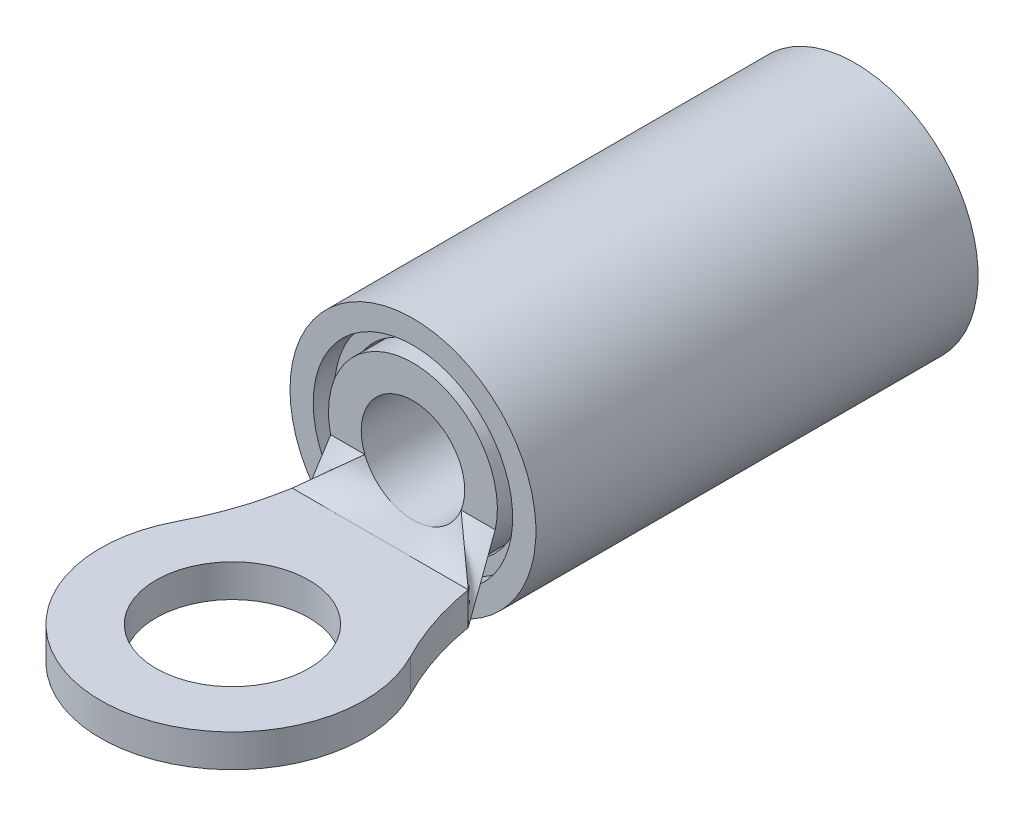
ISO-10303-21;
HEADER;
FILE_DESCRIPTION(('STEP AP214'),'2;1');
FILE_NAME('part.step','',(''),(''),'','','');
FILE_SCHEMA(('AUTOMOTIVE_DESIGN { 1 0 10303 214 1 1 1 1 }'));
ENDSEC;
DATA;
#1=APPLICATION_CONTEXT('core data for automotive mechanical design processes');
#2=APPLICATION_PROTOCOL_DEFINITION('international standard','automotive_design',2000,#1);
#3=PRODUCT_CONTEXT('',#1,'mechanical');
#4=PRODUCT('Part','Part','',(#3));
#5=PRODUCT_RELATED_PRODUCT_CATEGORY('part','',(#4));
#6=PRODUCT_DEFINITION_FORMATION('','',#4);
#7=PRODUCT_DEFINITION_CONTEXT('part definition',#1,'design');
#8=PRODUCT_DEFINITION('design','',#6,#7);
#9=PRODUCT_DEFINITION_SHAPE('','',#8);
#10=(LENGTH_UNIT() NAMED_UNIT(*) SI_UNIT(.MILLI.,.METRE.));
#11=(NAMED_UNIT(*) PLANE_ANGLE_UNIT() SI_UNIT($,.RADIAN.));
#12=(NAMED_UNIT(*) SI_UNIT($,.STERADIAN.) SOLID_ANGLE_UNIT());
#13=UNCERTAINTY_MEASURE_WITH_UNIT(LENGTH_MEASURE(1.E-05),#10,'distance_accuracy_value','');
#14=(GEOMETRIC_REPRESENTATION_CONTEXT(3) GLOBAL_UNCERTAINTY_ASSIGNED_CONTEXT((#13)) GLOBAL_UNIT_ASSIGNED_CONTEXT((#10,
#11,#12)) REPRESENTATION_CONTEXT('',''));
#15=CARTESIAN_POINT('',(0.,0.,0.));
#16=DIRECTION('',(0.,0.,1.));
#17=DIRECTION('',(1.,0.,0.));
#18=AXIS2_PLACEMENT_3D('',#15,#16,#17);
#19=CARTESIAN_POINT('',(-2.223273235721,0.7705356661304,-3.540252));
#20=CARTESIAN_POINT('',(-1.86805110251,1.062850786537,-3.813217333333));
#21=CARTESIAN_POINT('',(-1.5128289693,1.355165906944,-4.086182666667));
#22=CARTESIAN_POINT('',(-1.15760683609,1.647481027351,-4.359148));
#23=CARTESIAN_POINT('',(-2.194595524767,0.7709109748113,-3.540252));
#24=CARTESIAN_POINT('',(-1.846947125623,1.056720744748,-3.813217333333));
#25=CARTESIAN_POINT('',(-1.499298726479,1.342530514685,-4.086182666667));
#26=CARTESIAN_POINT('',(-1.151650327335,1.628340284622,-4.359148));
#27=CARTESIAN_POINT('',(-1.807565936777,0.7759372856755,-3.540252));
#28=CARTESIAN_POINT('',(-1.560091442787,0.9746243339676,-3.813217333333));
#29=CARTESIAN_POINT('',(-1.312616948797,1.17331138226,-4.086182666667));
#30=CARTESIAN_POINT('',(-1.065142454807,1.371998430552,-4.359148));
#31=CARTESIAN_POINT('',(-1.065350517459,0.7843492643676,-3.540252));
#32=CARTESIAN_POINT('',(-0.9557719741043,0.837228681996,-3.813217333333));
#33=CARTESIAN_POINT('',(-0.8461934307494,0.8901080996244,-4.086182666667));
#34=CARTESIAN_POINT('',(-0.7366148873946,0.9429875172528,-4.359148));
#35=CARTESIAN_POINT('',(0.,0.7889253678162,-3.540252));
#36=CARTESIAN_POINT('',(0.,0.762485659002,-3.813217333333));
#37=CARTESIAN_POINT('',(0.,0.7360459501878,-4.086182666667));
#38=CARTESIAN_POINT('',(0.,0.7096062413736,-4.359148));
#39=CARTESIAN_POINT('',(1.065350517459,0.7843492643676,-3.540252));
#40=CARTESIAN_POINT('',(0.9557719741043,0.837228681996,-3.813217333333));
#41=CARTESIAN_POINT('',(0.8461934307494,0.8901080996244,-4.086182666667));
#42=CARTESIAN_POINT('',(0.7366148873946,0.9429875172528,-4.359148));
#43=CARTESIAN_POINT('',(1.807565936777,0.7759372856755,-3.540252));
#44=CARTESIAN_POINT('',(1.560091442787,0.9746243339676,-3.813217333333));
#45=CARTESIAN_POINT('',(1.312616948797,1.17331138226,-4.086182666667));
#46=CARTESIAN_POINT('',(1.065142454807,1.371998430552,-4.359148));
#47=CARTESIAN_POINT('',(2.194595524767,0.7709109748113,-3.540252));
#48=CARTESIAN_POINT('',(1.846947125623,1.056720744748,-3.813217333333));
#49=CARTESIAN_POINT('',(1.499298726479,1.342530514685,-4.086182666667));
#50=CARTESIAN_POINT('',(1.151650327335,1.628340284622,-4.359148));
#51=CARTESIAN_POINT('',(2.223273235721,0.7705356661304,-3.540252));
#52=CARTESIAN_POINT('',(1.86805110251,1.062850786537,-3.813217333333));
#53=CARTESIAN_POINT('',(1.5128289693,1.355165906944,-4.086182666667));
#54=CARTESIAN_POINT('',(1.15760683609,1.647481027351,-4.359148));
#55=B_SPLINE_SURFACE_WITH_KNOTS('',3,3,((#19,#20,#21,#22),(#23,#24,#25,#26),(#27,#28,#29,#30),
(#31,#32,#33,#34),(#35,#36,#37,#38),(#39,#40,#41,#42),(#43,#44,#45,#46),(#47,#48,#49,#50),(#51,
#52,#53,#54)),.UNSPECIFIED.,.F.,.F.,.F.,(4,1,1,1,1,1,4),(4,4),(-0.02,0.,0.25,0.5,0.75,1.,1.02),
(-0.02,1.02),.UNSPECIFIED.);
#56=CARTESIAN_POINT('',(1.1781004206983,1.63061669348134,-4.3434));
#57=CARTESIAN_POINT('',(1.17170696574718,1.6118512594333,-4.3434));
#58=CARTESIAN_POINT('',(1.07941982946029,1.36053571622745,-4.3434));
#59=CARTESIAN_POINT('',(0.742936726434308,0.939936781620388,-4.3434));
#60=CARTESIAN_POINT('',(0.,0.711131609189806,-4.3434));
#61=CARTESIAN_POINT('',(-0.742936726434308,0.939936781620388,-4.3434));
#62=CARTESIAN_POINT('',(-1.07941982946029,1.36053571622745,-4.3434));
#63=CARTESIAN_POINT('',(-1.17170696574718,1.6118512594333,-4.3434));
#64=CARTESIAN_POINT('',(-1.1781004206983,1.63061669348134,-4.3434));
#65=B_SPLINE_CURVE_WITH_KNOTS('',3,(#56,#57,#58,#59,#60,#61,#62,#63,#64),.UNSPECIFIED.,.F.,.F.,
(4,1,1,1,1,1,4),(-0.02,0.,0.25,0.5,0.75,1.,1.02),.UNSPECIFIED.);
#66=CARTESIAN_POINT('',(0.,0.7874,-4.34339999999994));
#67=VERTEX_POINT('',#66);
#68=CARTESIAN_POINT('',(-1.15758253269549,1.57480000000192,-4.34339999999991));
#69=VERTEX_POINT('',#68);
#70=EDGE_CURVE('E199',#67,#69,#65,.T.);
#71=DIRECTION('',(-0.653141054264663,-0.53544689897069,0.535446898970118));
#72=VECTOR('',#71,1.);
#73=CARTESIAN_POINT('',(-1.637819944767,1.18110000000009,-3.9497));
#74=LINE('',#73,#72);
#75=CARTESIAN_POINT('',(-2.1180573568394,0.787399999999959,-3.55600000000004));
#76=VERTEX_POINT('',#75);
#77=EDGE_CURVE('E78',#69,#76,#74,.T.);
#78=DIRECTION('',(1.,0.,0.));
#79=VECTOR('',#78,1.);
#80=CARTESIAN_POINT('',(0.,0.7874,-3.556));
#81=LINE('',#80,#79);
#82=CARTESIAN_POINT('',(2.1180573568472,0.787399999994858,-3.55599999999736));
#83=VERTEX_POINT('',#82);
#84=EDGE_CURVE('E91',#83,#76,#81,.F.);
#85=DIRECTION('',(-0.653141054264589,0.535446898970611,-0.535446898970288));
#86=VECTOR('',#85,1.);
#87=CARTESIAN_POINT('',(1.63781994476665,1.18109999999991,-3.9497));
#88=LINE('',#87,#86);
#89=CARTESIAN_POINT('',(1.15758253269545,1.5748000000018,-4.3433999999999));
#90=VERTEX_POINT('',#89);
#91=EDGE_CURVE('E202',#83,#90,#88,.T.);
#92=CARTESIAN_POINT('',(1.17810042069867,1.63061669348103,-4.34339999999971));
#93=CARTESIAN_POINT('',(1.17170696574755,1.611851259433,-4.34339999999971));
#94=CARTESIAN_POINT('',(1.07941982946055,1.36053571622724,-4.34339999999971));
#95=CARTESIAN_POINT('',(0.742936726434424,0.939936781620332,-4.34339999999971));
#96=CARTESIAN_POINT('',(0.,0.711131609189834,-4.34339999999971));
#97=CARTESIAN_POINT('',(-0.742936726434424,0.939936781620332,-4.34339999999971));
#98=CARTESIAN_POINT('',(-1.07941982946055,1.36053571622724,-4.34339999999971));
#99=CARTESIAN_POINT('',(-1.17170696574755,1.611851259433,-4.34339999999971));
#100=CARTESIAN_POINT('',(-1.17810042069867,1.63061669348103,-4.34339999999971));
#101=B_SPLINE_CURVE_WITH_KNOTS('',3,(#92,#93,#94,#95,#96,#97,#98,#99,#100),.UNSPECIFIED.,.F.,
.F.,(4,1,1,1,1,1,4),(-0.02,0.,0.25,0.5,0.75,1.,1.02),.UNSPECIFIED.);
#102=EDGE_CURVE('E205',#90,#67,#101,.T.);
#103=ORIENTED_EDGE('',*,*,#70,.T.);
#104=ORIENTED_EDGE('',*,*,#77,.T.);
#105=ORIENTED_EDGE('',*,*,#84,.F.);
#106=ORIENTED_EDGE('',*,*,#91,.T.);
#107=ORIENTED_EDGE('',*,*,#102,.T.);
#108=EDGE_LOOP('',(#103,#104,#105,#106,#107));
#109=FACE_BOUND('',#108,.T.);
#110=ADVANCED_FACE('F15',(#109),#55,.T.);
#111=CARTESIAN_POINT('',(0.,0.7874,0.));
#112=DIRECTION('',(0.,1.,0.));
#113=DIRECTION('',(0.,0.,1.));
#114=AXIS2_PLACEMENT_3D('',#111,#112,#113);
#115=PLANE('',#114);
#116=CARTESIAN_POINT('',(0.,0.7874,0.));
#117=DIRECTION('',(0.,1.,0.));
#118=DIRECTION('',(0.,0.,1.));
#119=AXIS2_PLACEMENT_3D('',#116,#117,#118);
#120=CIRCLE('',#119,1.8415);
#121=CARTESIAN_POINT('',(0.,0.7874,1.8415));
#122=VERTEX_POINT('',#121);
#123=EDGE_CURVE('E286',#122,#122,#120,.F.);
#124=ORIENTED_EDGE('',*,*,#123,.T.);
#125=EDGE_LOOP('',(#124));
#126=FACE_BOUND('',#125,.T.);
#127=CARTESIAN_POINT('',(0.,0.7874,0.));
#128=DIRECTION('',(0.,1.,0.));
#129=DIRECTION('',(0.,0.,1.));
#130=AXIS2_PLACEMENT_3D('',#127,#128,#129);
#131=CIRCLE('',#130,3.175);
#132=CARTESIAN_POINT('',(2.81657050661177,0.7874,-1.46545405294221));
#133=VERTEX_POINT('',#132);
#134=CARTESIAN_POINT('',(-2.81657050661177,0.7874,-1.46545405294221));
#135=VERTEX_POINT('',#134);
#136=EDGE_CURVE('E89',#133,#135,#131,.F.);
#137=ORIENTED_EDGE('',*,*,#136,.F.);
#138=CARTESIAN_POINT('',(9.058090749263,0.7874,-4.712900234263));
#139=DIRECTION('',(0.,1.,0.));
#140=DIRECTION('',(0.,0.,1.));
#141=AXIS2_PLACEMENT_3D('',#138,#139,#140);
#142=CIRCLE('',#141,7.0358);
#143=EDGE_CURVE('E109',#133,#83,#142,.F.);
#144=ORIENTED_EDGE('',*,*,#143,.T.);
#145=ORIENTED_EDGE('',*,*,#84,.T.);
#146=CARTESIAN_POINT('',(-9.058090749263,0.7874,-4.712900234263));
#147=DIRECTION('',(0.,1.,0.));
#148=DIRECTION('',(0.,0.,1.));
#149=AXIS2_PLACEMENT_3D('',#146,#147,#148);
#150=CIRCLE('',#149,7.0358);
#151=EDGE_CURVE('E84',#76,#135,#150,.F.);
#152=ORIENTED_EDGE('',*,*,#151,.T.);
#153=EDGE_LOOP('',(#137,#144,#145,#152));
#154=FACE_BOUND('',#153,.T.);
#155=ADVANCED_FACE('F86',(#126,#154),#115,.T.);
#156=CARTESIAN_POINT('',(0.,2.032,-8.4836));
#157=DIRECTION('',(0.,0.,-1.));
#158=DIRECTION('',(-1.,0.,0.));
#159=AXIS2_PLACEMENT_3D('',#156,#157,#158);
#160=PLANE('',#159);
#161=CARTESIAN_POINT('',(0.,2.032,-8.4836));
#162=DIRECTION('',(0.,0.,-1.));
#163=DIRECTION('',(-1.,0.,0.));
#164=AXIS2_PLACEMENT_3D('',#161,#162,#163);
#165=CIRCLE('',#164,1.2446);
#166=CARTESIAN_POINT('',(-1.2446,2.032,-8.4836));
#167=VERTEX_POINT('',#166);
#168=EDGE_CURVE('E192',#167,#167,#165,.F.);
#169=ORIENTED_EDGE('',*,*,#168,.T.);
#170=EDGE_LOOP('',(#169));
#171=FACE_BOUND('',#170,.T.);
#172=ADVANCED_FACE('F311',(#171),#160,.F.);
#173=CARTESIAN_POINT('',(-9.058090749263,0.,-4.712900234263));
#174=DIRECTION('',(0.,1.,0.));
#175=DIRECTION('',(0.,0.,1.));
#176=AXIS2_PLACEMENT_3D('',#173,#174,#175);
#177=CYLINDRICAL_SURFACE('',#176,7.0358);
#178=DIRECTION('',(0.,1.,0.));
#179=VECTOR('',#178,1.);
#180=CARTESIAN_POINT('',(-2.8165705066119,0.,-1.46545405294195));
#181=LINE('',#180,#179);
#182=CARTESIAN_POINT('',(-2.81657050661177,0.,-1.46545405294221));
#183=VERTEX_POINT('',#182);
#184=EDGE_CURVE('E96',#135,#183,#181,.F.);
#185=ORIENTED_EDGE('',*,*,#184,.F.);
#186=ORIENTED_EDGE('',*,*,#151,.F.);
#187=DIRECTION('',(0.,1.,0.));
#188=VECTOR('',#187,1.);
#189=CARTESIAN_POINT('',(-2.11805735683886,0.,-3.55599999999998));
#190=LINE('',#189,#188);
#191=CARTESIAN_POINT('',(-2.11805735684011,-4.8139319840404E-13,-3.55600000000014));
#192=VERTEX_POINT('',#191);
#193=EDGE_CURVE('E93',#192,#76,#190,.T.);
#194=ORIENTED_EDGE('',*,*,#193,.F.);
#195=CARTESIAN_POINT('',(-9.058090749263,0.,-4.712900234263));
#196=DIRECTION('',(0.,1.,0.));
#197=DIRECTION('',(0.,0.,1.));
#198=AXIS2_PLACEMENT_3D('',#195,#196,#197);
#199=CIRCLE('',#198,7.0358);
#200=EDGE_CURVE('E99',#192,#183,#199,.F.);
#201=ORIENTED_EDGE('',*,*,#200,.T.);
#202=EDGE_LOOP('',(#185,#186,#194,#201));
#203=FACE_BOUND('',#202,.T.);
#204=ADVANCED_FACE('F97',(#203),#177,.F.);
#205=CARTESIAN_POINT('',(0.,0.,0.));
#206=DIRECTION('',(0.,1.,0.));
#207=DIRECTION('',(0.,0.,1.));
#208=AXIS2_PLACEMENT_3D('',#205,#206,#207);
#209=CYLINDRICAL_SURFACE('',#208,3.175);
#210=ORIENTED_EDGE('',*,*,#184,.T.);
#211=CARTESIAN_POINT('',(0.,0.,0.));
#212=DIRECTION('',(0.,1.,0.));
#213=DIRECTION('',(0.,0.,1.));
#214=AXIS2_PLACEMENT_3D('',#211,#212,#213);
#215=CIRCLE('',#214,3.175);
#216=CARTESIAN_POINT('',(2.81657050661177,0.,-1.46545405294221));
#217=VERTEX_POINT('',#216);
#218=EDGE_CURVE('E282',#183,#217,#215,.T.);
#219=ORIENTED_EDGE('',*,*,#218,.T.);
#220=DIRECTION('',(0.,1.,0.));
#221=VECTOR('',#220,1.);
#222=CARTESIAN_POINT('',(2.81657050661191,0.,-1.46545405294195));
#223=LINE('',#222,#221);
#224=EDGE_CURVE('E102',#217,#133,#223,.T.);
#225=ORIENTED_EDGE('',*,*,#224,.T.);
#226=ORIENTED_EDGE('',*,*,#136,.T.);
#227=EDGE_LOOP('',(#210,#219,#225,#226));
#228=FACE_BOUND('',#227,.T.);
#229=ADVANCED_FACE('F104',(#228),#209,.T.);
#230=CARTESIAN_POINT('',(9.058090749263,0.,-4.712900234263));
#231=DIRECTION('',(0.,1.,0.));
#232=DIRECTION('',(0.,0.,1.));
#233=AXIS2_PLACEMENT_3D('',#230,#231,#232);
#234=CYLINDRICAL_SURFACE('',#233,7.0358);
#235=ORIENTED_EDGE('',*,*,#224,.F.);
#236=CARTESIAN_POINT('',(9.058090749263,0.,-4.712900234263));
#237=DIRECTION('',(0.,1.,0.));
#238=DIRECTION('',(0.,0.,1.));
#239=AXIS2_PLACEMENT_3D('',#236,#237,#238);
#240=CIRCLE('',#239,7.0358);
#241=CARTESIAN_POINT('',(2.11805735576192,1.00318079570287E-11,-3.55599999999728));
#242=VERTEX_POINT('',#241);
#243=EDGE_CURVE('E279',#217,#242,#240,.F.);
#244=ORIENTED_EDGE('',*,*,#243,.T.);
#245=DIRECTION('',(-5.08995019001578E-11,-1.,0.));
#246=VECTOR('',#245,1.);
#247=CARTESIAN_POINT('',(2.11805735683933,0.393699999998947,-3.55599999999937));
#248=LINE('',#247,#246);
#249=EDGE_CURVE('E189',#83,#242,#248,.T.);
#250=ORIENTED_EDGE('',*,*,#249,.F.);
#251=ORIENTED_EDGE('',*,*,#143,.F.);
#252=EDGE_LOOP('',(#235,#244,#250,#251));
#253=FACE_BOUND('',#252,.T.);
#254=ADVANCED_FACE('F292',(#253),#234,.F.);
#255=CARTESIAN_POINT('',(0.,0.,0.));
#256=DIRECTION('',(0.,1.,0.));
#257=DIRECTION('',(0.,0.,1.));
#258=AXIS2_PLACEMENT_3D('',#255,#256,#257);
#259=CYLINDRICAL_SURFACE('',#258,1.8415);
#260=ORIENTED_EDGE('',*,*,#123,.F.);
#261=EDGE_LOOP('',(#260));
#262=FACE_BOUND('',#261,.T.);
#263=CARTESIAN_POINT('',(0.,0.,0.));
#264=DIRECTION('',(0.,1.,0.));
#265=DIRECTION('',(0.,0.,1.));
#266=AXIS2_PLACEMENT_3D('',#263,#264,#265);
#267=CIRCLE('',#266,1.8415);
#268=CARTESIAN_POINT('',(0.,0.,1.8415));
#269=VERTEX_POINT('',#268);
#270=EDGE_CURVE('E170',#269,#269,#267,.F.);
#271=ORIENTED_EDGE('',*,*,#270,.T.);
#272=EDGE_LOOP('',(#271));
#273=FACE_BOUND('',#272,.T.);
#274=ADVANCED_FACE('F308',(#262,#273),#259,.F.);
#275=CARTESIAN_POINT('',(0.,2.032,-4.13639));
#276=DIRECTION('',(0.,0.,-1.));
#277=DIRECTION('',(-1.,0.,0.));
#278=AXIS2_PLACEMENT_3D('',#275,#276,#277);
#279=CYLINDRICAL_SURFACE('',#278,1.2446);
#280=ORIENTED_EDGE('',*,*,#70,.F.);
#281=ORIENTED_EDGE('',*,*,#102,.F.);
#282=CARTESIAN_POINT('',(0.,2.032,-4.3434));
#283=DIRECTION('',(0.,0.,-1.));
#284=DIRECTION('',(-1.,0.,0.));
#285=AXIS2_PLACEMENT_3D('',#282,#283,#284);
#286=CIRCLE('',#285,1.2446);
#287=EDGE_CURVE('E159',#90,#69,#286,.F.);
#288=ORIENTED_EDGE('',*,*,#287,.T.);
#289=EDGE_LOOP('',(#280,#281,#288));
#290=FACE_BOUND('',#289,.T.);
#291=ORIENTED_EDGE('',*,*,#168,.F.);
#292=EDGE_LOOP('',(#291));
#293=FACE_BOUND('',#292,.T.);
#294=ADVANCED_FACE('F305',(#290,#293),#279,.F.);
#295=CARTESIAN_POINT('',(2.137771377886,0.7962902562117,-3.540252));
#296=CARTESIAN_POINT('',(1.796061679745,1.06088180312,-3.813217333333));
#297=CARTESIAN_POINT('',(1.454351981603,1.325473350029,-4.086182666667));
#298=CARTESIAN_POINT('',(1.112642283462,1.590064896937,-4.359148));
#299=CARTESIAN_POINT('',(2.137603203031,0.7880775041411,-3.540252));
#300=CARTESIAN_POINT('',(1.798808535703,1.055460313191,-3.813217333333));
#301=CARTESIAN_POINT('',(1.460013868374,1.322843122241,-4.086182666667));
#302=CARTESIAN_POINT('',(1.121219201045,1.590225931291,-4.359148));
#303=CARTESIAN_POINT('',(2.131952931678,0.5121487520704,-3.540252));
#304=CARTESIAN_POINT('',(1.891096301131,0.8733112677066,-3.813217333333));
#305=CARTESIAN_POINT('',(1.650239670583,1.234473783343,-4.086182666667));
#306=CARTESIAN_POINT('',(1.409383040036,1.595636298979,-4.359148));
#307=CARTESIAN_POINT('',(2.126134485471,0.2280072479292,-3.540252));
#308=CARTESIAN_POINT('',(1.986130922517,0.6857407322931,-3.813217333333));
#309=CARTESIAN_POINT('',(1.846127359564,1.143474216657,-4.086182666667));
#310=CARTESIAN_POINT('',(1.70612379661,1.601207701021,-4.359148));
#311=CARTESIAN_POINT('',(2.120484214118,-0.04792150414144,-3.540252));
#312=CARTESIAN_POINT('',(2.078418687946,0.5035916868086,-3.813217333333));
#313=CARTESIAN_POINT('',(2.036353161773,1.055104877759,-4.086182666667));
#314=CARTESIAN_POINT('',(1.9942876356,1.606618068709,-4.359148));
#315=CARTESIAN_POINT('',(2.120316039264,-0.05613425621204,-3.540252));
#316=CARTESIAN_POINT('',(2.081165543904,0.4981701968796,-3.813217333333));
#317=CARTESIAN_POINT('',(2.042015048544,1.052474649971,-4.086182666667));
#318=CARTESIAN_POINT('',(2.002864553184,1.606779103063,-4.359148));
#319=B_SPLINE_SURFACE_WITH_KNOTS('',3,3,((#295,#296,#297,#298),(#299,#300,#301,#302),(#303,#304,
#305,#306),(#307,#308,#309,#310),(#311,#312,#313,#314),(#315,#316,#317,#318)),.UNSPECIFIED.,.F.,
.F.,.F.,(4,1,1,4),(4,4),(-0.03067710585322,0.,1.,1.030677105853),(-0.02000000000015,1.02),.UNSPECIFIED.);
#320=DIRECTION('',(0.0782294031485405,-0.891686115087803,0.445843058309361));
#321=VECTOR('',#320,1.);
#322=CARTESIAN_POINT('',(2.04897718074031,0.787399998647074,-3.9497));
#323=LINE('',#322,#321);
#324=CARTESIAN_POINT('',(1.97989700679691,1.57479999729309,-4.34339999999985));
#325=VERTEX_POINT('',#324);
#326=EDGE_CURVE('E151',#325,#242,#323,.T.);
#327=DIRECTION('',(-1.,0.,0.));
#328=VECTOR('',#327,1.);
#329=CARTESIAN_POINT('',(0.,1.574799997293,-4.3434));
#330=LINE('',#329,#328);
#331=EDGE_CURVE('E162',#325,#90,#330,.T.);
#332=ORIENTED_EDGE('',*,*,#326,.F.);
#333=ORIENTED_EDGE('',*,*,#331,.T.);
#334=ORIENTED_EDGE('',*,*,#91,.F.);
#335=ORIENTED_EDGE('',*,*,#249,.T.);
#336=EDGE_LOOP('',(#332,#333,#334,#335));
#337=FACE_BOUND('',#336,.T.);
#338=ADVANCED_FACE('F227',(#337),#319,.T.);
#339=CARTESIAN_POINT('',(0.,0.,0.));
#340=DIRECTION('',(0.,1.,0.));
#341=DIRECTION('',(0.,0.,1.));
#342=AXIS2_PLACEMENT_3D('',#339,#340,#341);
#343=PLANE('',#342);
#344=ORIENTED_EDGE('',*,*,#270,.F.);
#345=EDGE_LOOP('',(#344));
#346=FACE_BOUND('',#345,.T.);
#347=DIRECTION('',(-1.,1.70301800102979E-13,0.));
#348=VECTOR('',#347,1.);
#349=CARTESIAN_POINT('',(0.,0.,-3.556));
#350=LINE('',#349,#348);
#351=EDGE_CURVE('E158',#242,#192,#350,.T.);
#352=ORIENTED_EDGE('',*,*,#351,.F.);
#353=ORIENTED_EDGE('',*,*,#243,.F.);
#354=ORIENTED_EDGE('',*,*,#218,.F.);
#355=ORIENTED_EDGE('',*,*,#200,.F.);
#356=EDGE_LOOP('',(#352,#353,#354,#355));
#357=FACE_BOUND('',#356,.T.);
#358=ADVANCED_FACE('F299',(#346,#357),#343,.F.);
#359=CARTESIAN_POINT('',(-2.120316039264,-0.05613425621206,-3.540252));
#360=CARTESIAN_POINT('',(-2.081165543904,0.4981701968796,-3.813217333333));
#361=CARTESIAN_POINT('',(-2.042015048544,1.052474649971,-4.086182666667));
#362=CARTESIAN_POINT('',(-2.002864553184,1.606779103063,-4.359148));
#363=CARTESIAN_POINT('',(-2.120484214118,-0.04792150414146,-3.540252));
#364=CARTESIAN_POINT('',(-2.078418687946,0.5035916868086,-3.813217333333));
#365=CARTESIAN_POINT('',(-2.036353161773,1.055104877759,-4.086182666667));
#366=CARTESIAN_POINT('',(-1.9942876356,1.606618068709,-4.359148));
#367=CARTESIAN_POINT('',(-2.126134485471,0.2280072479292,-3.540252));
#368=CARTESIAN_POINT('',(-1.986130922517,0.6857407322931,-3.813217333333));
#369=CARTESIAN_POINT('',(-1.846127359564,1.143474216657,-4.086182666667));
#370=CARTESIAN_POINT('',(-1.70612379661,1.601207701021,-4.359148));
#371=CARTESIAN_POINT('',(-2.131952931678,0.5121487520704,-3.540252));
#372=CARTESIAN_POINT('',(-1.891096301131,0.8733112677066,-3.813217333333));
#373=CARTESIAN_POINT('',(-1.650239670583,1.234473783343,-4.086182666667));
#374=CARTESIAN_POINT('',(-1.409383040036,1.595636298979,-4.359148));
#375=CARTESIAN_POINT('',(-2.137603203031,0.7880775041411,-3.540252));
#376=CARTESIAN_POINT('',(-1.798808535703,1.055460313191,-3.813217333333));
#377=CARTESIAN_POINT('',(-1.460013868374,1.322843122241,-4.086182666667));
#378=CARTESIAN_POINT('',(-1.121219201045,1.590225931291,-4.359148));
#379=CARTESIAN_POINT('',(-2.137771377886,0.7962902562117,-3.540252));
#380=CARTESIAN_POINT('',(-1.796061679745,1.06088180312,-3.813217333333));
#381=CARTESIAN_POINT('',(-1.454351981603,1.325473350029,-4.086182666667));
#382=CARTESIAN_POINT('',(-1.112642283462,1.590064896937,-4.359148));
#383=B_SPLINE_SURFACE_WITH_KNOTS('',3,3,((#359,#360,#361,#362),(#363,#364,#365,#366),(#367,#368,
#369,#370),(#371,#372,#373,#374),(#375,#376,#377,#378),(#379,#380,#381,#382)),.UNSPECIFIED.,.F.,
.F.,.F.,(4,1,1,4),(4,4),(-0.03067710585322,0.,1.,1.030677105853),(-0.02000000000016,1.02),.UNSPECIFIED.);
#384=DIRECTION('',(-1.,0.,0.));
#385=VECTOR('',#384,1.);
#386=CARTESIAN_POINT('',(0.,1.5748,-4.3434));
#387=LINE('',#386,#385);
#388=CARTESIAN_POINT('',(-1.97989700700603,1.57479999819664,-4.34339999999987));
#389=VERTEX_POINT('',#388);
#390=EDGE_CURVE('E165',#69,#389,#387,.T.);
#391=DIRECTION('',(0.0782294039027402,0.89168611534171,-0.445843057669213));
#392=VECTOR('',#391,1.);
#393=CARTESIAN_POINT('',(-2.04897718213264,0.787400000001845,-3.9497));
#394=LINE('',#393,#392);
#395=EDGE_CURVE('E176',#192,#389,#394,.T.);
#396=ORIENTED_EDGE('',*,*,#77,.F.);
#397=ORIENTED_EDGE('',*,*,#390,.T.);
#398=ORIENTED_EDGE('',*,*,#395,.F.);
#399=ORIENTED_EDGE('',*,*,#193,.T.);
#400=EDGE_LOOP('',(#396,#397,#398,#399));
#401=FACE_BOUND('',#400,.T.);
#402=ADVANCED_FACE('F301',(#401),#383,.T.);
#403=CARTESIAN_POINT('',(0.,2.032,-4.3434));
#404=DIRECTION('',(0.,0.,-1.));
#405=DIRECTION('',(-1.,0.,0.));
#406=AXIS2_PLACEMENT_3D('',#403,#404,#405);
#407=PLANE('',#406);
#408=ORIENTED_EDGE('',*,*,#287,.F.);
#409=ORIENTED_EDGE('',*,*,#331,.F.);
#410=CARTESIAN_POINT('',(0.,2.032,-4.3434));
#411=DIRECTION('',(0.,0.,-1.));
#412=DIRECTION('',(-1.,0.,0.));
#413=AXIS2_PLACEMENT_3D('',#410,#411,#412);
#414=CIRCLE('',#413,2.032);
#415=EDGE_CURVE('E269',#389,#325,#414,.T.);
#416=ORIENTED_EDGE('',*,*,#415,.F.);
#417=ORIENTED_EDGE('',*,*,#390,.F.);
#418=EDGE_LOOP('',(#408,#409,#416,#417));
#419=FACE_BOUND('',#418,.T.);
#420=ADVANCED_FACE('F132',(#419),#407,.F.);
#421=CARTESIAN_POINT('',(2.206803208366,-0.03363673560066,-3.540252));
#422=CARTESIAN_POINT('',(2.137061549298,0.5494000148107,-3.813217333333));
#423=CARTESIAN_POINT('',(2.067319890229,1.132436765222,-4.086182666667));
#424=CARTESIAN_POINT('',(1.99757823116,1.715473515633,-4.359148));
#425=CARTESIAN_POINT('',(2.178123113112,-0.03291943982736,-3.540252));
#426=CARTESIAN_POINT('',(2.115996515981,0.5376841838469,-3.813217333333));
#427=CARTESIAN_POINT('',(2.053869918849,1.108287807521,-4.086182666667));
#428=CARTESIAN_POINT('',(1.991743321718,1.678891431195,-4.359148));
#429=CARTESIAN_POINT('',(1.791197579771,-0.0232789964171,-3.540252));
#430=CARTESIAN_POINT('',(1.827441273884,0.380223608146,-3.813217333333));
#431=CARTESIAN_POINT('',(1.863684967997,0.7837262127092,-4.086182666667));
#432=CARTESIAN_POINT('',(1.89992866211,1.187228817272,-4.359148));
#433=CARTESIAN_POINT('',(1.230406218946,-0.01044825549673,-3.540252));
#434=CARTESIAN_POINT('',(1.31927836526,0.1706548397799,-3.813217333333));
#435=CARTESIAN_POINT('',(1.408150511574,0.3517579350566,-4.086182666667));
#436=CARTESIAN_POINT('',(1.497022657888,0.5328610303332,-4.359148));
#437=CARTESIAN_POINT('',(0.5264551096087,-0.001545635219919,-3.540252));
#438=CARTESIAN_POINT('',(0.5794817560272,0.02524537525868,-3.813217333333));
#439=CARTESIAN_POINT('',(0.6325084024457,0.05203638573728,-4.086182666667));
#440=CARTESIAN_POINT('',(0.6855350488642,0.07882739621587,-4.359148));
#441=CARTESIAN_POINT('',(0.,0.0007728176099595,-3.540252));
#442=CARTESIAN_POINT('',(0.,-0.01262268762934,-3.813217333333));
#443=CARTESIAN_POINT('',(0.,-0.02601819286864,-4.086182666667));
#444=CARTESIAN_POINT('',(0.,-0.03941369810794,-4.359148));
#445=CARTESIAN_POINT('',(-0.5264551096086,-0.001545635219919,-3.540252));
#446=CARTESIAN_POINT('',(-0.5794817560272,0.02524537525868,-3.813217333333));
#447=CARTESIAN_POINT('',(-0.6325084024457,0.05203638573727,-4.086182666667));
#448=CARTESIAN_POINT('',(-0.6855350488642,0.07882739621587,-4.359148));
#449=CARTESIAN_POINT('',(-1.230406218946,-0.01044825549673,-3.540252));
#450=CARTESIAN_POINT('',(-1.31927836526,0.1706548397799,-3.813217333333));
#451=CARTESIAN_POINT('',(-1.408150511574,0.3517579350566,-4.086182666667));
#452=CARTESIAN_POINT('',(-1.497022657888,0.5328610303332,-4.359148));
#453=CARTESIAN_POINT('',(-1.791197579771,-0.0232789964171,-3.540252));
#454=CARTESIAN_POINT('',(-1.827441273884,0.380223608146,-3.813217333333));
#455=CARTESIAN_POINT('',(-1.863684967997,0.7837262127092,-4.086182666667));
#456=CARTESIAN_POINT('',(-1.89992866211,1.187228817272,-4.359148));
#457=CARTESIAN_POINT('',(-2.178123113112,-0.03291943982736,-3.540252));
#458=CARTESIAN_POINT('',(-2.115996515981,0.5376841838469,-3.813217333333));
#459=CARTESIAN_POINT('',(-2.053869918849,1.108287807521,-4.086182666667));
#460=CARTESIAN_POINT('',(-1.991743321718,1.678891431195,-4.359148));
#461=CARTESIAN_POINT('',(-2.206803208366,-0.03363673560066,-3.540252));
#462=CARTESIAN_POINT('',(-2.137061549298,0.5494000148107,-3.813217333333));
#463=CARTESIAN_POINT('',(-2.067319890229,1.132436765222,-4.086182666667));
#464=CARTESIAN_POINT('',(-1.99757823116,1.715473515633,-4.359148));
#465=B_SPLINE_SURFACE_WITH_KNOTS('',3,3,((#421,#422,#423,#424),(#425,#426,#427,#428),(#429,#430,
#431,#432),(#433,#434,#435,#436),(#437,#438,#439,#440),(#441,#442,#443,#444),(#445,#446,#447,
#448),(#449,#450,#451,#452),(#453,#454,#455,#456),(#457,#458,#459,#460),(#461,#462,#463,#464)),
.UNSPECIFIED.,.F.,.F.,.F.,(4,1,1,1,1,1,1,1,4),(4,4),(-0.02,0.,0.25,0.375,0.5,0.625,0.75,1.,
1.02),(-0.02,1.02),.UNSPECIFIED.);
#466=CARTESIAN_POINT('',(-2.00160178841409,1.68183678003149,-4.34339999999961));
#467=CARTESIAN_POINT('',(-1.99532754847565,1.6459719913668,-4.34339999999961));
#468=CARTESIAN_POINT('',(-1.89783767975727,1.16394982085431,-4.34339999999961));
#469=CARTESIAN_POINT('',(-1.49189541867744,0.522412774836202,-4.34339999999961));
#470=CARTESIAN_POINT('',(-0.682475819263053,0.0772817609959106,-4.34339999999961));
#471=CARTESIAN_POINT('',(0.,-0.0386408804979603,-4.34339999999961));
#472=CARTESIAN_POINT('',(0.682475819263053,0.0772817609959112,-4.34339999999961));
#473=CARTESIAN_POINT('',(1.49189541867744,0.522412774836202,-4.34339999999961));
#474=CARTESIAN_POINT('',(1.89783767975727,1.16394982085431,-4.34339999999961));
#475=CARTESIAN_POINT('',(1.99532754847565,1.6459719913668,-4.34339999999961));
#476=CARTESIAN_POINT('',(2.00160178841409,1.68183678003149,-4.34339999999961));
#477=B_SPLINE_CURVE_WITH_KNOTS('',3,(#466,#467,#468,#469,#470,#471,#472,#473,#474,#475,#476),
.UNSPECIFIED.,.F.,.F.,(4,1,1,1,1,1,1,1,4),(-0.02,0.,0.25,0.375,0.5,0.625,0.75,1.,1.02),.UNSPECIFIED.);
#478=CARTESIAN_POINT('',(0.,0.,-4.34339999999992));
#479=VERTEX_POINT('',#478);
#480=EDGE_CURVE('E39',#479,#389,#477,.F.);
#481=CARTESIAN_POINT('',(-2.00160178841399,1.68183678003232,-4.3434));
#482=CARTESIAN_POINT('',(-1.99532754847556,1.64597199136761,-4.3434));
#483=CARTESIAN_POINT('',(-1.89783767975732,1.16394982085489,-4.3434));
#484=CARTESIAN_POINT('',(-1.49189541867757,0.52241277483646,-4.3434));
#485=CARTESIAN_POINT('',(-0.682475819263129,0.0772817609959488,-4.3434));
#486=CARTESIAN_POINT('',(0.,-0.0386408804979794,-4.3434));
#487=CARTESIAN_POINT('',(0.682475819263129,0.0772817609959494,-4.3434));
#488=CARTESIAN_POINT('',(1.49189541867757,0.52241277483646,-4.3434));
#489=CARTESIAN_POINT('',(1.89783767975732,1.16394982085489,-4.3434));
#490=CARTESIAN_POINT('',(1.99532754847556,1.64597199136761,-4.3434));
#491=CARTESIAN_POINT('',(2.00160178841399,1.68183678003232,-4.3434));
#492=B_SPLINE_CURVE_WITH_KNOTS('',3,(#481,#482,#483,#484,#485,#486,#487,#488,#489,#490,#491),
.UNSPECIFIED.,.F.,.F.,(4,1,1,1,1,1,1,1,4),(-0.02,0.,0.25,0.375,0.5,0.625,0.75,1.,1.02),.UNSPECIFIED.);
#493=EDGE_CURVE('E147',#325,#479,#492,.F.);
#494=ORIENTED_EDGE('',*,*,#395,.T.);
#495=ORIENTED_EDGE('',*,*,#480,.F.);
#496=ORIENTED_EDGE('',*,*,#493,.F.);
#497=ORIENTED_EDGE('',*,*,#326,.T.);
#498=ORIENTED_EDGE('',*,*,#351,.T.);
#499=EDGE_LOOP('',(#494,#495,#496,#497,#498));
#500=FACE_BOUND('',#499,.T.);
#501=ADVANCED_FACE('F17',(#500),#465,.T.);
#502=CARTESIAN_POINT('',(0.,2.032,-4.13639));
#503=DIRECTION('',(0.,0.,-1.));
#504=DIRECTION('',(-1.,0.,0.));
#505=AXIS2_PLACEMENT_3D('',#502,#503,#504);
#506=CYLINDRICAL_SURFACE('',#505,2.032);
#507=CARTESIAN_POINT('',(0.,2.032,-8.4836));
#508=DIRECTION('',(0.,0.,-1.));
#509=DIRECTION('',(-1.,0.,0.));
#510=AXIS2_PLACEMENT_3D('',#507,#508,#509);
#511=CIRCLE('',#510,2.032);
#512=CARTESIAN_POINT('',(-2.032,2.032,-8.4836));
#513=VERTEX_POINT('',#512);
#514=EDGE_CURVE('E266',#513,#513,#511,.F.);
#515=ORIENTED_EDGE('',*,*,#514,.T.);
#516=EDGE_LOOP('',(#515));
#517=FACE_BOUND('',#516,.T.);
#518=ORIENTED_EDGE('',*,*,#493,.T.);
#519=ORIENTED_EDGE('',*,*,#480,.T.);
#520=ORIENTED_EDGE('',*,*,#415,.T.);
#521=EDGE_LOOP('',(#518,#519,#520));
#522=FACE_BOUND('',#521,.T.);
#523=ADVANCED_FACE('F119',(#517,#522),#506,.T.);
#524=CARTESIAN_POINT('',(0.,2.032,-8.4836));
#525=DIRECTION('',(0.,0.,-1.));
#526=DIRECTION('',(-1.,0.,0.));
#527=AXIS2_PLACEMENT_3D('',#524,#525,#526);
#528=PLANE('',#527);
#529=ORIENTED_EDGE('',*,*,#514,.F.);
#530=EDGE_LOOP('',(#529));
#531=FACE_BOUND('',#530,.T.);
#532=CARTESIAN_POINT('',(0.,2.032,-8.4836));
#533=DIRECTION('',(0.,0.,-1.));
#534=DIRECTION('',(-1.,0.,0.));
#535=AXIS2_PLACEMENT_3D('',#532,#533,#534);
#536=CIRCLE('',#535,2.0701);
#537=CARTESIAN_POINT('',(-2.0701,2.032,-8.4836));
#538=VERTEX_POINT('',#537);
#539=EDGE_CURVE('E263',#538,#538,#536,.F.);
#540=ORIENTED_EDGE('',*,*,#539,.T.);
#541=EDGE_LOOP('',(#540));
#542=FACE_BOUND('',#541,.T.);
#543=ADVANCED_FACE('F129',(#531,#542),#528,.F.);
#544=CARTESIAN_POINT('',(0.,2.032,-3.81127));
#545=DIRECTION('',(0.,0.,-1.));
#546=DIRECTION('',(-1.,0.,0.));
#547=AXIS2_PLACEMENT_3D('',#544,#545,#546);
#548=CYLINDRICAL_SURFACE('',#547,2.0701);
#549=CARTESIAN_POINT('',(0.,2.032,-4.8514));
#550=DIRECTION('',(0.,0.,-1.));
#551=DIRECTION('',(-1.,0.,0.));
#552=AXIS2_PLACEMENT_3D('',#549,#550,#551);
#553=CIRCLE('',#552,2.0701);
#554=CARTESIAN_POINT('',(-2.0701,2.032,-4.8514));
#555=VERTEX_POINT('',#554);
#556=EDGE_CURVE('E260',#555,#555,#553,.F.);
#557=ORIENTED_EDGE('',*,*,#556,.T.);
#558=EDGE_LOOP('',(#557));
#559=FACE_BOUND('',#558,.T.);
#560=ORIENTED_EDGE('',*,*,#539,.F.);
#561=EDGE_LOOP('',(#560));
#562=FACE_BOUND('',#561,.T.);
#563=ADVANCED_FACE('F350',(#559,#562),#548,.F.);
#564=CARTESIAN_POINT('',(0.,2.032,-4.8514));
#565=DIRECTION('',(0.,0.,-1.));
#566=DIRECTION('',(-1.,0.,0.));
#567=AXIS2_PLACEMENT_3D('',#564,#565,#566);
#568=PLANE('',#567);
#569=ORIENTED_EDGE('',*,*,#556,.F.);
#570=EDGE_LOOP('',(#569));
#571=FACE_BOUND('',#570,.T.);
#572=CARTESIAN_POINT('',(0.,2.032,-4.8514));
#573=DIRECTION('',(0.,0.,-1.));
#574=DIRECTION('',(-1.,0.,0.));
#575=AXIS2_PLACEMENT_3D('',#572,#573,#574);
#576=CIRCLE('',#575,2.4003);
#577=CARTESIAN_POINT('',(-2.4003,2.032,-4.8514));
#578=VERTEX_POINT('',#577);
#579=EDGE_CURVE('E257',#578,#578,#576,.F.);
#580=ORIENTED_EDGE('',*,*,#579,.T.);
#581=EDGE_LOOP('',(#580));
#582=FACE_BOUND('',#581,.T.);
#583=ADVANCED_FACE('F347',(#571,#582),#568,.F.);
#584=CARTESIAN_POINT('',(0.,2.032,-13.8811));
#585=DIRECTION('',(0.,0.,-1.));
#586=DIRECTION('',(-1.,0.,0.));
#587=AXIS2_PLACEMENT_3D('',#584,#585,#586);
#588=PLANE('',#587);
#589=CARTESIAN_POINT('',(0.,2.032,-13.8811));
#590=DIRECTION('',(0.,0.,-1.));
#591=DIRECTION('',(-1.,0.,0.));
#592=AXIS2_PLACEMENT_3D('',#589,#590,#591);
#593=CIRCLE('',#592,2.4003);
#594=CARTESIAN_POINT('',(-2.4003,2.032,-13.8811));
#595=VERTEX_POINT('',#594);
#596=EDGE_CURVE('E254',#595,#595,#593,.T.);
#597=ORIENTED_EDGE('',*,*,#596,.T.);
#598=EDGE_LOOP('',(#597));
#599=FACE_BOUND('',#598,.T.);
#600=ADVANCED_FACE('F343',(#599),#588,.T.);
#601=CARTESIAN_POINT('',(0.,2.032,-3.81127));
#602=DIRECTION('',(0.,0.,-1.));
#603=DIRECTION('',(-1.,0.,0.));
#604=AXIS2_PLACEMENT_3D('',#601,#602,#603);
#605=CYLINDRICAL_SURFACE('',#604,2.4003);
#606=CARTESIAN_POINT('',(0.,2.032,-4.3434));
#607=DIRECTION('',(0.,0.,-1.));
#608=DIRECTION('',(-1.,0.,0.));
#609=AXIS2_PLACEMENT_3D('',#606,#607,#608);
#610=CIRCLE('',#609,2.4003);
#611=CARTESIAN_POINT('',(-2.4003,2.032,-4.3434));
#612=VERTEX_POINT('',#611);
#613=EDGE_CURVE('E251',#612,#612,#610,.F.);
#614=ORIENTED_EDGE('',*,*,#613,.T.);
#615=EDGE_LOOP('',(#614));
#616=FACE_BOUND('',#615,.T.);
#617=ORIENTED_EDGE('',*,*,#579,.F.);
#618=EDGE_LOOP('',(#617));
#619=FACE_BOUND('',#618,.T.);
#620=ADVANCED_FACE('F339',(#616,#619),#605,.F.);
#621=CARTESIAN_POINT('',(0.,2.032,-3.81127));
#622=DIRECTION('',(0.,0.,-1.));
#623=DIRECTION('',(-1.,0.,0.));
#624=AXIS2_PLACEMENT_3D('',#621,#622,#623);
#625=CYLINDRICAL_SURFACE('',#624,2.4003);
#626=ORIENTED_EDGE('',*,*,#596,.F.);
#627=EDGE_LOOP('',(#626));
#628=FACE_BOUND('',#627,.T.);
#629=CARTESIAN_POINT('',(0.,2.032,-14.986));
#630=DIRECTION('',(0.,0.,-1.));
#631=DIRECTION('',(-1.,0.,0.));
#632=AXIS2_PLACEMENT_3D('',#629,#630,#631);
#633=CIRCLE('',#632,2.4003);
#634=CARTESIAN_POINT('',(-2.4003,2.032,-14.986));
#635=VERTEX_POINT('',#634);
#636=EDGE_CURVE('E248',#635,#635,#633,.F.);
#637=ORIENTED_EDGE('',*,*,#636,.F.);
#638=EDGE_LOOP('',(#637));
#639=FACE_BOUND('',#638,.T.);
#640=ADVANCED_FACE('F335',(#628,#639),#625,.F.);
#641=CARTESIAN_POINT('',(0.,2.032,-4.3434));
#642=DIRECTION('',(0.,0.,-1.));
#643=DIRECTION('',(-1.,0.,0.));
#644=AXIS2_PLACEMENT_3D('',#641,#642,#643);
#645=PLANE('',#644);
#646=ORIENTED_EDGE('',*,*,#613,.F.);
#647=EDGE_LOOP('',(#646));
#648=FACE_BOUND('',#647,.T.);
#649=CARTESIAN_POINT('',(0.,2.032,-4.3434));
#650=DIRECTION('',(0.,0.,-1.));
#651=DIRECTION('',(-1.,0.,0.));
#652=AXIS2_PLACEMENT_3D('',#649,#650,#651);
#653=CIRCLE('',#652,2.9591);
#654=CARTESIAN_POINT('',(-2.9591,2.032,-4.3434));
#655=VERTEX_POINT('',#654);
#656=EDGE_CURVE('E30',#655,#655,#653,.T.);
#657=ORIENTED_EDGE('',*,*,#656,.F.);
#658=EDGE_LOOP('',(#657));
#659=FACE_BOUND('',#658,.T.);
#660=ADVANCED_FACE('F328',(#648,#659),#645,.F.);
#661=CARTESIAN_POINT('',(0.,2.032,-14.986));
#662=DIRECTION('',(0.,0.,-1.));
#663=DIRECTION('',(-1.,0.,0.));
#664=AXIS2_PLACEMENT_3D('',#661,#662,#663);
#665=PLANE('',#664);
#666=ORIENTED_EDGE('',*,*,#636,.T.);
#667=EDGE_LOOP('',(#666));
#668=FACE_BOUND('',#667,.T.);
#669=CARTESIAN_POINT('',(0.,2.032,-14.986));
#670=DIRECTION('',(0.,0.,-1.));
#671=DIRECTION('',(-1.,0.,0.));
#672=AXIS2_PLACEMENT_3D('',#669,#670,#671);
#673=CIRCLE('',#672,2.9591);
#674=CARTESIAN_POINT('',(-2.9591,2.032,-14.986));
#675=VERTEX_POINT('',#674);
#676=EDGE_CURVE('E10',#675,#675,#673,.F.);
#677=ORIENTED_EDGE('',*,*,#676,.F.);
#678=EDGE_LOOP('',(#677));
#679=FACE_BOUND('',#678,.T.);
#680=ADVANCED_FACE('F321',(#668,#679),#665,.T.);
#681=CARTESIAN_POINT('',(0.,2.032,-3.81127));
#682=DIRECTION('',(0.,0.,-1.));
#683=DIRECTION('',(-1.,0.,0.));
#684=AXIS2_PLACEMENT_3D('',#681,#682,#683);
#685=CYLINDRICAL_SURFACE('',#684,2.9591);
#686=ORIENTED_EDGE('',*,*,#676,.T.);
#687=EDGE_LOOP('',(#686));
#688=FACE_BOUND('',#687,.T.);
#689=ORIENTED_EDGE('',*,*,#656,.T.);
#690=EDGE_LOOP('',(#689));
#691=FACE_BOUND('',#690,.T.);
#692=ADVANCED_FACE('F319',(#688,#691),#685,.T.);
#693=CLOSED_SHELL('',(#110,#155,#172,#204,#229,#254,#274,#294,#338,#358,#402,#420,#501,#523,
#543,#563,#583,#600,#620,#640,#660,#680,#692));
#694=MANIFOLD_SOLID_BREP('B1',#693);
#695=ADVANCED_BREP_SHAPE_REPRESENTATION('',(#18,#694),#14);
#696=SHAPE_DEFINITION_REPRESENTATION(#9,#695);
ENDSEC;
END-ISO-10303-21;
